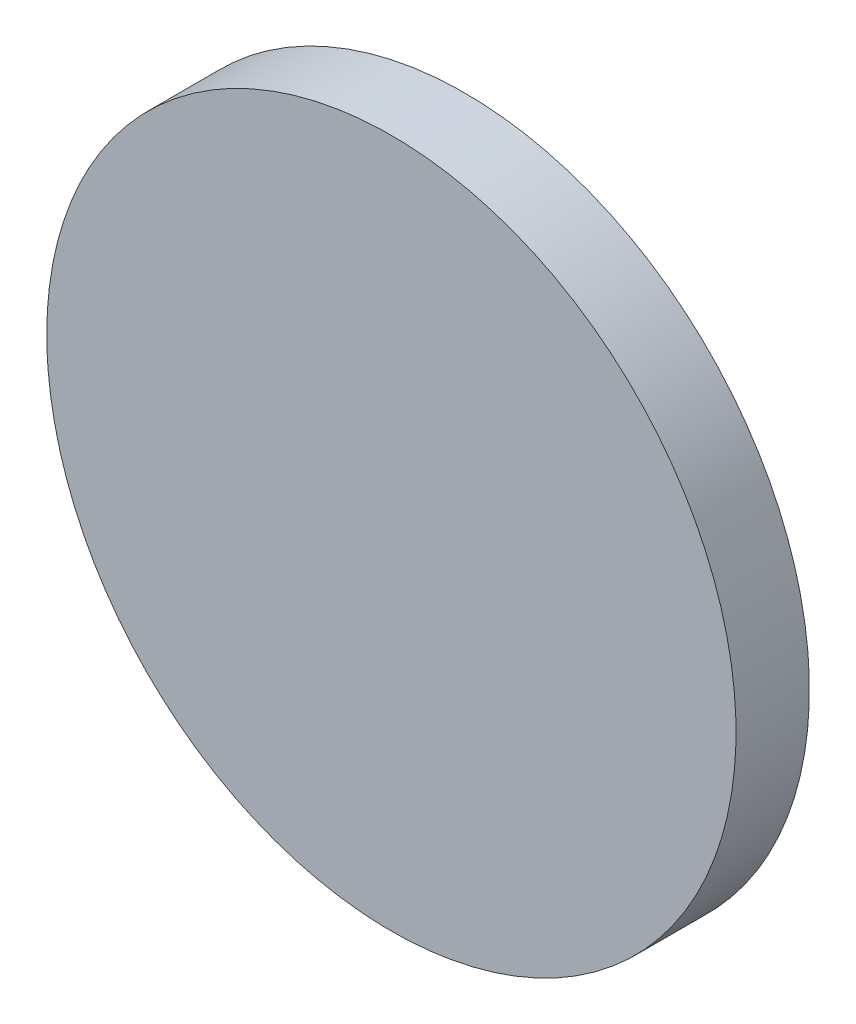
ISO-10303-21;
HEADER;
FILE_DESCRIPTION(('STEP AP214'),'2;1');
FILE_NAME('part.step','',(''),(''),'','','');
FILE_SCHEMA(('AUTOMOTIVE_DESIGN { 1 0 10303 214 1 1 1 1 }'));
ENDSEC;
DATA;
#1=APPLICATION_CONTEXT('core data for automotive mechanical design processes');
#2=APPLICATION_PROTOCOL_DEFINITION('international standard','automotive_design',2000,#1);
#3=PRODUCT_CONTEXT('',#1,'mechanical');
#4=PRODUCT('Part','Part','',(#3));
#5=PRODUCT_RELATED_PRODUCT_CATEGORY('part','',(#4));
#6=PRODUCT_DEFINITION_FORMATION('','',#4);
#7=PRODUCT_DEFINITION_CONTEXT('part definition',#1,'design');
#8=PRODUCT_DEFINITION('design','',#6,#7);
#9=PRODUCT_DEFINITION_SHAPE('','',#8);
#10=(LENGTH_UNIT() NAMED_UNIT(*) SI_UNIT(.MILLI.,.METRE.));
#11=(NAMED_UNIT(*) PLANE_ANGLE_UNIT() SI_UNIT($,.RADIAN.));
#12=(NAMED_UNIT(*) SI_UNIT($,.STERADIAN.) SOLID_ANGLE_UNIT());
#13=UNCERTAINTY_MEASURE_WITH_UNIT(LENGTH_MEASURE(1.E-05),#10,'distance_accuracy_value','');
#14=(GEOMETRIC_REPRESENTATION_CONTEXT(3) GLOBAL_UNCERTAINTY_ASSIGNED_CONTEXT((#13)) GLOBAL_UNIT_ASSIGNED_CONTEXT((#10,
#11,#12)) REPRESENTATION_CONTEXT('',''));
#15=CARTESIAN_POINT('',(0.,0.,0.));
#16=DIRECTION('',(0.,0.,1.));
#17=DIRECTION('',(1.,0.,0.));
#18=AXIS2_PLACEMENT_3D('',#15,#16,#17);
#19=CARTESIAN_POINT('',(-240.63228365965,-193.133656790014,-2576.69295055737));
#20=CARTESIAN_POINT('',(-240.632276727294,-194.816174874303,-2576.69295055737));
#21=CARTESIAN_POINT('',(-240.468140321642,-198.181301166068,-2576.69295055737));
#22=CARTESIAN_POINT('',(-239.724890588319,-203.179947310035,-2576.69295055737));
#23=CARTESIAN_POINT('',(-238.498671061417,-208.082666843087,-2576.69295055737));
#24=CARTESIAN_POINT('',(-236.794494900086,-212.84026258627,-2576.69295055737));
#25=CARTESIAN_POINT('',(-234.63535199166,-217.409599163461,-2576.69295055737));
#26=CARTESIAN_POINT('',(-232.035756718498,-221.743309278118,-2576.69295055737));
#27=CARTESIAN_POINT('',(-229.026667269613,-225.803613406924,-2576.69295055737));
#28=CARTESIAN_POINT('',(-225.63156373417,-229.54689629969,-2576.69295055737));
#29=CARTESIAN_POINT('',(-221.888168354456,-232.942140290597,-2576.69295055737));
#30=CARTESIAN_POINT('',(-217.828017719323,-235.951145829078,-2576.69295055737));
#31=CARTESIAN_POINT('',(-213.494168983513,-238.55085514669,-2576.69295055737));
#32=CARTESIAN_POINT('',(-208.925004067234,-240.709945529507,-2576.69295055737));
#33=CARTESIAN_POINT('',(-204.167253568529,-242.414204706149,-2576.69295055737));
#34=CARTESIAN_POINT('',(-199.264667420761,-243.640412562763,-2576.69295055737));
#35=CARTESIAN_POINT('',(-194.265851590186,-244.383737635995,-2576.69295055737));
#36=CARTESIAN_POINT('',(-189.218241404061,-244.629933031,-2576.69295055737));
#37=CARTESIAN_POINT('',(-184.170461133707,-244.383752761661,-2576.69295055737));
#38=CARTESIAN_POINT('',(-179.171808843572,-243.640479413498,-2576.69295055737));
#39=CARTESIAN_POINT('',(-174.269051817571,-242.414256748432,-2576.69295055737));
#40=CARTESIAN_POINT('',(-169.511452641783,-240.710076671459,-2576.69295055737));
#41=CARTESIAN_POINT('',(-164.942124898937,-238.550935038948,-2576.69295055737));
#42=CARTESIAN_POINT('',(-160.608410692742,-235.951338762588,-2576.69295055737));
#43=CARTESIAN_POINT('',(-156.548108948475,-232.942252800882,-2576.69295055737));
#44=CARTESIAN_POINT('',(-152.804821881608,-229.547141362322,-2576.69295055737));
#45=CARTESIAN_POINT('',(-149.409581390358,-225.803748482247,-2576.69295055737));
#46=CARTESIAN_POINT('',(-146.40057588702,-221.743597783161,-2576.69295055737));
#47=CARTESIAN_POINT('',(-143.800875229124,-217.409753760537,-2576.69295055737));
#48=CARTESIAN_POINT('',(-141.641781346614,-212.840590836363,-2576.69295055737));
#49=CARTESIAN_POINT('',(-139.937518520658,-208.082841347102,-2576.69295055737));
#50=CARTESIAN_POINT('',(-138.711313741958,-203.180249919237,-2576.69295055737));
#51=CARTESIAN_POINT('',(-137.967990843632,-198.181433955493,-2576.69295055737));
#52=CARTESIAN_POINT('',(-137.721793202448,-193.133828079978,-2576.69295055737));
#53=CARTESIAN_POINT('',(-137.967975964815,-188.0860522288,-2576.69295055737));
#54=CARTESIAN_POINT('',(-138.711244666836,-183.087407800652,-2576.69295055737));
#55=CARTESIAN_POINT('',(-139.937467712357,-178.184646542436,-2576.69295055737));
#56=CARTESIAN_POINT('',(-141.64164570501,-173.427051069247,-2576.69295055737));
#57=CARTESIAN_POINT('',(-143.800787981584,-168.857714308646,-2576.69295055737));
#58=CARTESIAN_POINT('',(-146.400386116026,-164.524001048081,-2576.69295055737));
#59=CARTESIAN_POINT('',(-149.40947394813,-160.463695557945,-2576.69295055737));
#60=CARTESIAN_POINT('',(-152.804585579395,-156.720408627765,-2576.69295055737));
#61=CARTESIAN_POINT('',(-156.54797832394,-153.325167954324,-2576.69295055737));
#62=CARTESIAN_POINT('',(-160.608132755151,-150.316160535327,-2576.69295055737));
#63=CARTESIAN_POINT('',(-164.941975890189,-147.716458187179,-2576.69295055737));
#64=CARTESIAN_POINT('',(-169.511143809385,-145.557364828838,-2576.69295055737));
#65=CARTESIAN_POINT('',(-174.268890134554,-143.853105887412,-2576.69295055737));
#66=CARTESIAN_POINT('',(-179.171480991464,-142.62689934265,-2576.69295055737));
#67=CARTESIAN_POINT('',(-184.170292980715,-141.883577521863,-2576.69295055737));
#68=CARTESIAN_POINT('',(-189.217902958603,-141.637380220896,-2576.69295055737));
#69=CARTESIAN_POINT('',(-194.26567907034,-141.883560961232,-2576.69295055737));
#70=CARTESIAN_POINT('',(-199.264331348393,-142.62683412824,-2576.69295055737));
#71=CARTESIAN_POINT('',(-204.167088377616,-143.853056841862,-2576.69295055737));
#72=CARTESIAN_POINT('',(-208.924687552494,-145.557236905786,-2576.69295055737));
#73=CARTESIAN_POINT('',(-213.49401529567,-147.716378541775,-2576.69295055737));
#74=CARTESIAN_POINT('',(-217.827729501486,-150.315974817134,-2576.69295055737));
#75=CARTESIAN_POINT('',(-221.888031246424,-153.325060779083,-2576.69295055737));
#76=CARTESIAN_POINT('',(-225.631318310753,-156.720172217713,-2576.69295055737));
#77=CARTESIAN_POINT('',(-229.026558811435,-160.463565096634,-2576.69295055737));
#78=CARTESIAN_POINT('',(-232.035564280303,-164.523715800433,-2576.69295055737));
#79=CARTESIAN_POINT('',(-234.635265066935,-168.857559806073,-2576.69295055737));
#80=CARTESIAN_POINT('',(-236.794358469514,-173.426722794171,-2576.69295055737));
#81=CARTESIAN_POINT('',(-238.498623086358,-178.18447204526,-2576.69295055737));
#82=CARTESIAN_POINT('',(-239.724831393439,-183.087105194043,-2576.69295055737));
#83=CARTESIAN_POINT('',(-240.468173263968,-188.085919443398,-2576.69295055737));
#84=CARTESIAN_POINT('',(-240.632290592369,-191.451050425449,-2576.69295055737));
#85=CARTESIAN_POINT('',(-240.63228365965,-193.133656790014,-2576.69295055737));
#86=B_SPLINE_CURVE_WITH_KNOTS('',3,(#19,#20,#21,#22,#23,#24,#25,#26,#27,#28,#29,#30,#31,#32,#33,
#34,#35,#36,#37,#38,#39,#40,#41,#42,#43,#44,#45,#46,#47,#48,#49,#50,#51,#52,#53,#54,#55,#56,#57,
#58,#59,#60,#61,#62,#63,#64,#65,#66,#67,#68,#69,#70,#71,#72,#73,#74,#75,#76,#77,#78,#79,#80,#81,
#82,#83,#84,#85),.UNSPECIFIED.,.T.,.F.,(4,1,1,1,1,1,1,1,1,1,1,1,1,1,1,1,1,1,1,1,1,1,1,1,1,1,1,1,
1,1,1,1,1,1,1,1,1,1,1,1,1,1,1,1,1,1,1,1,1,1,1,1,1,1,1,1,1,1,1,1,1,1,1,1,4),(0.,
0.0156245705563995,0.0312499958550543,0.0468741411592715,0.0624999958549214,0.0781241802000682,
0.0937499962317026,0.109374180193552,0.124999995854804,0.140624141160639,0.156249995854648,
0.17187418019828,0.187499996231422,0.203124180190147,0.218749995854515,0.234374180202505,
0.249999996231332,0.265624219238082,0.281249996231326,0.296874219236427,0.312499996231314,
0.328124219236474,0.343749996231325,0.35937421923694,0.374999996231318,0.390624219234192,
0.406249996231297,0.421874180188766,0.437499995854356,0.453124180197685,0.468749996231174,
0.484374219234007,0.499999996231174,0.515624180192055,0.531249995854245,0.546874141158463,
0.562499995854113,0.578124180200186,0.593749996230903,0.609374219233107,0.624999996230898,
0.64062421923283,0.656249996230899,0.671874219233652,0.687499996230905,0.703124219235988,
0.71874999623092,0.73437421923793,0.749999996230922,0.765624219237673,0.781249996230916,
0.796874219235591,0.812499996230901,0.828124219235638,0.843749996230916,0.859374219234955,
0.874999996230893,0.890624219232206,0.906249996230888,0.921874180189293,0.937499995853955,
0.953124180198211,0.968749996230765,0.984374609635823,1.),.UNSPECIFIED.);
#87=DIRECTION('',(0.,0.,-1.));
#88=VECTOR('',#87,1.);
#89=SURFACE_OF_LINEAR_EXTRUSION('',#86,#88);
#90=CARTESIAN_POINT('',(-240.63228365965,-193.133656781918,-2576.69295055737));
#91=CARTESIAN_POINT('',(-240.632284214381,-192.305332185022,-2576.69295055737));
#92=CARTESIAN_POINT('',(-240.612400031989,-191.476989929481,-2576.69295055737));
#93=CARTESIAN_POINT('',(-240.532662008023,-189.822252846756,-2576.69295055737));
#94=CARTESIAN_POINT('',(-240.472809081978,-188.995857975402,-2576.69295055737));
#95=CARTESIAN_POINT('',(-240.312933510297,-187.346961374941,-2576.69295055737));
#96=CARTESIAN_POINT('',(-240.212910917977,-186.524459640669,-2576.69295055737));
#97=CARTESIAN_POINT('',(-239.973247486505,-184.885236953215,-2576.69295055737));
#98=CARTESIAN_POINT('',(-239.833605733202,-184.068516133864,-2576.69295055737));
#99=CARTESIAN_POINT('',(-239.515285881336,-182.442716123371,-2576.69295055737));
#100=CARTESIAN_POINT('',(-239.336607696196,-181.633636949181,-2576.69295055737));
#101=CARTESIAN_POINT('',(-238.94042890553,-180.025052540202,-2576.69295055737));
#102=CARTESIAN_POINT('',(-238.722929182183,-179.225547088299,-2576.69295055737));
#103=CARTESIAN_POINT('',(-238.249262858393,-177.638075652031,-2576.69295055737));
#104=CARTESIAN_POINT('',(-237.993096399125,-176.850109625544,-2576.69295055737));
#105=CARTESIAN_POINT('',(-237.442968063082,-175.287470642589,-2576.69295055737));
#106=CARTESIAN_POINT('',(-237.149005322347,-174.512797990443,-2576.69295055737));
#107=CARTESIAN_POINT('',(-236.524233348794,-172.97845368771,-2576.69295055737));
#108=CARTESIAN_POINT('',(-236.193423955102,-172.218782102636,-2576.69295055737));
#109=CARTESIAN_POINT('',(-235.495566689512,-170.716283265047,-2576.69295055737));
#110=CARTESIAN_POINT('',(-235.128519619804,-169.973455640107,-2576.69295055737));
#111=CARTESIAN_POINT('',(-234.358704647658,-168.506550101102,-2576.69295055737));
#112=CARTESIAN_POINT('',(-233.955936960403,-167.782472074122,-2576.69295055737));
#113=CARTESIAN_POINT('',(-233.115840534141,-166.354636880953,-2576.69295055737));
#114=CARTESIAN_POINT('',(-232.67851101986,-165.650880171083,-2576.69295055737));
#115=CARTESIAN_POINT('',(-231.770569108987,-164.26517004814,-2576.69295055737));
#116=CARTESIAN_POINT('',(-231.299956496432,-163.583216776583,-2576.69295055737));
#117=CARTESIAN_POINT('',(-230.326422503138,-162.242789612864,-2576.69295055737));
#118=CARTESIAN_POINT('',(-229.823501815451,-161.584315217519,-2576.69295055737));
#119=CARTESIAN_POINT('',(-228.786216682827,-160.292623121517,-2576.69295055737));
#120=CARTESIAN_POINT('',(-228.251852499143,-159.659405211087,-2576.69295055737));
#121=CARTESIAN_POINT('',(-227.153089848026,-158.419570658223,-2576.69295055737));
#122=CARTESIAN_POINT('',(-226.588690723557,-157.812954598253,-2576.69295055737));
#123=CARTESIAN_POINT('',(-225.431413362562,-156.627518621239,-2576.69295055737));
#124=CARTESIAN_POINT('',(-224.838534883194,-156.048698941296,-2576.69295055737));
#125=CARTESIAN_POINT('',(-223.625596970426,-154.920292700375,-2576.69295055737));
#126=CARTESIAN_POINT('',(-223.00553809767,-154.370705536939,-2576.69295055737));
#127=CARTESIAN_POINT('',(-221.73942488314,-153.302347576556,-2576.69295055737));
#128=CARTESIAN_POINT('',(-221.093370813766,-152.783576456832,-2576.69295055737));
#129=CARTESIAN_POINT('',(-219.776881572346,-151.777932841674,-2576.69295055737));
#130=CARTESIAN_POINT('',(-219.106445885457,-151.291061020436,-2576.69295055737));
#131=CARTESIAN_POINT('',(-217.742960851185,-150.350074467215,-2576.69295055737));
#132=CARTESIAN_POINT('',(-217.049911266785,-149.895960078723,-2576.69295055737));
#133=CARTESIAN_POINT('',(-215.642764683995,-149.021624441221,-2576.69295055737));
#134=CARTESIAN_POINT('',(-214.928668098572,-148.601402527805,-2576.69295055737));
#135=CARTESIAN_POINT('',(-213.480893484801,-147.796180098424,-2576.69295055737));
#136=CARTESIAN_POINT('',(-212.747215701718,-147.411179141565,-2576.69295055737));
#137=CARTESIAN_POINT('',(-211.262049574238,-146.67719087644,-2576.69295055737));
#138=CARTESIAN_POINT('',(-210.51056087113,-146.328204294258,-2576.69295055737));
#139=CARTESIAN_POINT('',(-208.991679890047,-145.66673246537,-2576.69295055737));
#140=CARTESIAN_POINT('',(-208.224287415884,-145.354247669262,-2576.69295055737));
#141=CARTESIAN_POINT('',(-206.675365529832,-144.766565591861,-2576.69295055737));
#142=CARTESIAN_POINT('',(-205.893836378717,-144.491367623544,-2576.69295055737));
#143=CARTESIAN_POINT('',(-204.318335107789,-143.979279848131,-2576.69295055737));
#144=CARTESIAN_POINT('',(-203.524363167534,-143.742389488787,-2576.69295055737));
#145=CARTESIAN_POINT('',(-201.925852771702,-143.307399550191,-2576.69295055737));
#146=CARTESIAN_POINT('',(-201.121314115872,-143.109300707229,-2576.69295055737));
#147=CARTESIAN_POINT('',(-199.503639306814,-142.751992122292,-2576.69295055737));
#148=CARTESIAN_POINT('',(-198.690503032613,-142.59278292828,-2576.69295055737));
#149=CARTESIAN_POINT('',(-197.057523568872,-142.313656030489,-2576.69295055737));
#150=CARTESIAN_POINT('',(-196.237680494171,-142.193737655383,-2576.69295055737));
#151=CARTESIAN_POINT('',(-194.593146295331,-141.993863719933,-2576.69295055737));
#152=CARTESIAN_POINT('',(-193.76845524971,-141.913907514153,-2576.69295055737));
#153=CARTESIAN_POINT('',(-192.116154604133,-141.794119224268,-2576.69295055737));
#154=CARTESIAN_POINT('',(-191.288544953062,-141.754287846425,-2576.69295055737));
#155=CARTESIAN_POINT('',(-189.632359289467,-141.714455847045,-2576.69295055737));
#156=CARTESIAN_POINT('',(-188.803783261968,-141.7144558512,-2576.69295055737));
#157=CARTESIAN_POINT('',(-187.147597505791,-141.754287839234,-2576.69295055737));
#158=CARTESIAN_POINT('',(-186.319987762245,-141.794119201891,-2576.69295055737));
#159=CARTESIAN_POINT('',(-184.667687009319,-141.91390737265,-2576.69295055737));
#160=CARTESIAN_POINT('',(-183.842995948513,-141.993863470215,-2576.69295055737));
#161=CARTESIAN_POINT('',(-182.198461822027,-142.193737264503,-2576.69295055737));
#162=CARTESIAN_POINT('',(-181.378618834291,-142.313655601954,-2576.69295055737));
#163=CARTESIAN_POINT('',(-179.745639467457,-142.592782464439,-2576.69295055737));
#164=CARTESIAN_POINT('',(-178.932503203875,-142.751991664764,-2576.69295055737));
#165=CARTESIAN_POINT('',(-177.314828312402,-143.109300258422,-2576.69295055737));
#166=CARTESIAN_POINT('',(-176.510289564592,-143.307399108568,-2576.69295055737));
#167=CARTESIAN_POINT('',(-174.911779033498,-143.742388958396,-2576.69295055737));
#168=CARTESIAN_POINT('',(-174.117807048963,-143.979279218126,-2576.69295055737));
#169=CARTESIAN_POINT('',(-172.542305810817,-144.491366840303,-2576.69295055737));
#170=CARTESIAN_POINT('',(-171.760776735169,-144.766564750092,-2576.69295055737));
#171=CARTESIAN_POINT('',(-170.211854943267,-145.35424676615,-2576.69295055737));
#172=CARTESIAN_POINT('',(-169.444462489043,-145.666731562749,-2576.69295055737));
#173=CARTESIAN_POINT('',(-167.925581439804,-146.328203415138,-2576.69295055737));
#174=CARTESIAN_POINT('',(-167.174092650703,-146.677190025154,-2576.69295055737));
#175=CARTESIAN_POINT('',(-165.688926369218,-147.411178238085,-2576.69295055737));
#176=CARTESIAN_POINT('',(-164.955248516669,-147.79617911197,-2576.69295055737));
#177=CARTESIAN_POINT('',(-163.507473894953,-148.601401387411,-2576.69295055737));
#178=CARTESIAN_POINT('',(-162.793377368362,-149.02162322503,-2576.69295055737));
#179=CARTESIAN_POINT('',(-161.386230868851,-149.895958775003,-2576.69295055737));
#180=CARTESIAN_POINT('',(-160.693181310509,-150.350073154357,-2576.69295055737));
#181=CARTESIAN_POINT('',(-159.32969622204,-151.291059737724,-2576.69295055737));
#182=CARTESIAN_POINT('',(-158.659260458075,-151.777931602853,-2576.69295055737));
#183=CARTESIAN_POINT('',(-157.342771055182,-152.78357520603,-2576.69295055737));
#184=CARTESIAN_POINT('',(-156.696716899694,-153.302346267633,-2576.69295055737));
#185=CARTESIAN_POINT('',(-155.430603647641,-154.370704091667,-2576.69295055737));
#186=CARTESIAN_POINT('',(-154.810544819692,-154.920291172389,-2576.69295055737));
#187=CARTESIAN_POINT('',(-153.597606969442,-156.048697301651,-2576.69295055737));
#188=CARTESIAN_POINT('',(-153.004728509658,-156.62751695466,-2576.69295055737));
#189=CARTESIAN_POINT('',(-151.847451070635,-157.812952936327,-2576.69295055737));
#190=CARTESIAN_POINT('',(-151.283051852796,-158.419569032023,-2576.69295055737));
#191=CARTESIAN_POINT('',(-150.184289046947,-159.659403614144,-2576.69295055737));
#192=CARTESIAN_POINT('',(-149.649924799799,-160.29262151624,-2576.69295055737));
#193=CARTESIAN_POINT('',(-148.61263974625,-161.584313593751,-2576.69295055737));
#194=CARTESIAN_POINT('',(-148.10971919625,-162.242787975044,-2576.69295055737));
#195=CARTESIAN_POINT('',(-147.136185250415,-163.583215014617,-2576.69295055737));
#196=CARTESIAN_POINT('',(-146.665572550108,-164.265168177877,-2576.69295055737));
#197=CARTESIAN_POINT('',(-145.757629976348,-165.650877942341,-2576.69295055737));
#198=CARTESIAN_POINT('',(-145.320299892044,-166.354634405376,-2576.69295055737));
#199=CARTESIAN_POINT('',(-144.48020248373,-167.782469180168,-2576.69295055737));
#200=CARTESIAN_POINT('',(-144.077434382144,-168.506547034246,-2576.69295055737));
#201=CARTESIAN_POINT('',(-143.307619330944,-169.973452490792,-2576.69295055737));
#202=CARTESIAN_POINT('',(-142.940572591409,-170.716280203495,-2576.69295055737));
#203=CARTESIAN_POINT('',(-142.242716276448,-172.218779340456,-2576.69295055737));
#204=CARTESIAN_POINT('',(-141.911907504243,-172.978451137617,-2576.69295055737));
#205=CARTESIAN_POINT('',(-141.287136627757,-174.512795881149,-2576.69295055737));
#206=CARTESIAN_POINT('',(-140.99317436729,-175.287468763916,-2576.69295055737));
#207=CARTESIAN_POINT('',(-140.443046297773,-176.850107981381,-2576.69295055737));
#208=CARTESIAN_POINT('',(-140.18687962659,-177.638074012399,-2576.69295055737));
#209=CARTESIAN_POINT('',(-139.713211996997,-179.225545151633,-2576.69295055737));
#210=CARTESIAN_POINT('',(-139.495711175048,-180.025050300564,-2576.69295055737));
#211=CARTESIAN_POINT('',(-139.099531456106,-181.633634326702,-2576.69295055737));
#212=CARTESIAN_POINT('',(-138.920853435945,-182.442713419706,-2576.69295055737));
#213=CARTESIAN_POINT('',(-138.602536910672,-184.068514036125,-2576.69295055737));
#214=CARTESIAN_POINT('',(-138.462898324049,-184.885235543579,-2576.69295055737));
#215=CARTESIAN_POINT('',(-138.223240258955,-186.524458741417,-2576.69295055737));
#216=CARTESIAN_POINT('',(-138.123219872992,-187.346960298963,-2576.69295055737));
#217=CARTESIAN_POINT('',(-137.963345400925,-188.995858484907,-2576.69295055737));
#218=CARTESIAN_POINT('',(-137.903491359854,-189.822255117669,-2576.69295055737));
#219=CARTESIAN_POINT('',(-137.8237465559,-191.476986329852,-2576.69295055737));
#220=CARTESIAN_POINT('',(-137.803856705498,-192.305320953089,-2576.69295055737));
#221=CARTESIAN_POINT('',(-137.80385636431,-193.961990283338,-2576.69295055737));
#222=CARTESIAN_POINT('',(-137.82374587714,-194.79032499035,-2576.69295055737));
#223=CARTESIAN_POINT('',(-137.903490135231,-196.445056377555,-2576.69295055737));
#224=CARTESIAN_POINT('',(-137.963343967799,-197.271453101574,-2576.69295055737));
#225=CARTESIAN_POINT('',(-138.123218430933,-198.920351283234,-2576.69295055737));
#226=CARTESIAN_POINT('',(-138.223239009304,-199.742852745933,-2576.69295055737));
#227=CARTESIAN_POINT('',(-138.46289753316,-201.382075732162,-2576.69295055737));
#228=CARTESIAN_POINT('',(-138.602536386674,-202.198797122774,-2576.69295055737));
#229=CARTESIAN_POINT('',(-138.920852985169,-203.824597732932,-2576.69295055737));
#230=CARTESIAN_POINT('',(-139.099530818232,-204.63367693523,-2576.69295055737));
#231=CARTESIAN_POINT('',(-139.495709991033,-206.242261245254,-2576.69295055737));
#232=CARTESIAN_POINT('',(-139.71321045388,-207.041766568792,-2576.69295055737));
#233=CARTESIAN_POINT('',(-140.186877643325,-208.629237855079,-2576.69295055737));
#234=CARTESIAN_POINT('',(-140.443044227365,-209.417203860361,-2576.69295055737));
#235=CARTESIAN_POINT('',(-140.993172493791,-210.979842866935,-2576.69295055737));
#236=CARTESIAN_POINT('',(-141.287135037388,-211.754515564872,-2576.69295055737));
#237=CARTESIAN_POINT('',(-141.911906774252,-213.288859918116,-2576.69295055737));
#238=CARTESIAN_POINT('',(-142.242716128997,-214.048531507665,-2576.69295055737));
#239=CARTESIAN_POINT('',(-142.94057340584,-215.551030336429,-2576.69295055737));
#240=CARTESIAN_POINT('',(-143.307620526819,-216.293857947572,-2576.69295055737));
#241=CARTESIAN_POINT('',(-144.077435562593,-217.760763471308,-2576.69295055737));
#242=CARTESIAN_POINT('',(-144.480203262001,-218.484841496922,-2576.69295055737));
#243=CARTESIAN_POINT('',(-145.320299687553,-219.912676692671,-2576.69295055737));
#244=CARTESIAN_POINT('',(-145.757629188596,-220.616433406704,-2576.69295055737));
#245=CARTESIAN_POINT('',(-146.665571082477,-222.002143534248,-2576.69295055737));
#246=CARTESIAN_POINT('',(-147.136183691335,-222.684096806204,-2576.69295055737));
#247=CARTESIAN_POINT('',(-148.1097176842,-224.02452396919,-2576.69295055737));
#248=CARTESIAN_POINT('',(-148.612638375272,-224.682998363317,-2576.69295055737));
#249=CARTESIAN_POINT('',(-149.649923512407,-225.974690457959,-2576.69295055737));
#250=CARTESIAN_POINT('',(-150.184287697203,-226.60790836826,-2576.69295055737));
#251=CARTESIAN_POINT('',(-151.28305034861,-227.847742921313,-2576.69295055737));
#252=CARTESIAN_POINT('',(-151.847449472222,-228.454358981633,-2576.69295055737));
#253=CARTESIAN_POINT('',(-153.00472683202,-229.639794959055,-2576.69295055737));
#254=CARTESIAN_POINT('',(-153.597605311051,-230.218614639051,-2576.69295055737));
#255=CARTESIAN_POINT('',(-154.810543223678,-231.347020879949,-2576.69295055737));
#256=CARTESIAN_POINT('',(-155.430602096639,-231.896608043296,-2576.69295055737));
#257=CARTESIAN_POINT('',(-156.696715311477,-232.964966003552,-2576.69295055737));
#258=CARTESIAN_POINT('',(-157.342769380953,-233.483737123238,-2576.69295055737));
#259=CARTESIAN_POINT('',(-158.659258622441,-234.48938073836,-2576.69295055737));
#260=CARTESIAN_POINT('',(-159.329694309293,-234.976252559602,-2576.69295055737));
#261=CARTESIAN_POINT('',(-160.693179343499,-235.9172391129,-2576.69295055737));
#262=CARTESIAN_POINT('',(-161.386228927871,-236.371353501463,-2576.69295055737));
#263=CARTESIAN_POINT('',(-162.793375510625,-237.245689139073,-2576.69295055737));
#264=CARTESIAN_POINT('',(-163.50747209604,-237.665911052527,-2576.69295055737));
#265=CARTESIAN_POINT('',(-164.955246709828,-238.471133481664,-2576.69295055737));
#266=CARTESIAN_POINT('',(-165.688924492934,-238.856134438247,-2576.69295055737));
#267=CARTESIAN_POINT('',(-167.174090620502,-239.590122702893,-2576.69295055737));
#268=CARTESIAN_POINT('',(-167.925579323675,-239.939109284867,-2576.69295055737));
#269=CARTESIAN_POINT('',(-169.444460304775,-240.600581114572,-2576.69295055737));
#270=CARTESIAN_POINT('',(-170.211852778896,-240.913065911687,-2576.69295055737));
#271=CARTESIAN_POINT('',(-171.760774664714,-241.500747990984,-2576.69295055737));
#272=CARTESIAN_POINT('',(-172.542303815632,-241.775945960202,-2576.69295055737));
#273=CARTESIAN_POINT('',(-174.117805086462,-242.288033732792,-2576.69295055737));
#274=CARTESIAN_POINT('',(-174.911777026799,-242.524924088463,-2576.69295055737));
#275=CARTESIAN_POINT('',(-176.510287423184,-242.959914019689,-2576.69295055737));
#276=CARTESIAN_POINT('',(-177.314826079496,-243.158012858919,-2576.69295055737));
#277=CARTESIAN_POINT('',(-178.932500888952,-243.515321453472,-2576.69295055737));
#278=CARTESIAN_POINT('',(-179.7456371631,-243.674530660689,-2576.69295055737));
#279=CARTESIAN_POINT('',(-181.378616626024,-243.953657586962,-2576.69295055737));
#280=CARTESIAN_POINT('',(-182.198459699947,-244.073575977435,-2576.69295055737));
#281=CARTESIAN_POINT('',(-183.84299389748,-244.273449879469,-2576.69295055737));
#282=CARTESIAN_POINT('',(-184.66768494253,-244.35340603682,-2576.69295055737));
#283=CARTESIAN_POINT('',(-186.319985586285,-244.473194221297,-2576.69295055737));
#284=CARTESIAN_POINT('',(-187.147595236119,-244.513025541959,-2576.69295055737));
#285=CARTESIAN_POINT('',(-188.803780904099,-244.552857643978,-2576.69295055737));
#286=CARTESIAN_POINT('',(-189.632356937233,-244.552857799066,-2576.69295055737));
#287=CARTESIAN_POINT('',(-191.288542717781,-244.513026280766,-2576.69295055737));
#288=CARTESIAN_POINT('',(-192.116152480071,-244.473195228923,-2576.69295055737));
#289=CARTESIAN_POINT('',(-193.768453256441,-244.353407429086,-2576.69295055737));
#290=CARTESIAN_POINT('',(-194.593144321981,-244.273451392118,-2576.69295055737));
#291=CARTESIAN_POINT('',(-196.237678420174,-244.073577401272,-2576.69295055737));
#292=CARTESIAN_POINT('',(-197.057521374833,-243.953658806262,-2576.69295055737));
#293=CARTESIAN_POINT('',(-198.690500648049,-243.674531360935,-2576.69295055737));
#294=CARTESIAN_POINT('',(-199.503636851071,-243.515321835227,-2576.69295055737));
#295=CARTESIAN_POINT('',(-201.121311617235,-243.158012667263,-2576.69295055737));
#296=CARTESIAN_POINT('',(-201.925850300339,-242.959913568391,-2576.69295055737));
#297=CARTESIAN_POINT('',(-203.524360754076,-242.524923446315,-2576.69295055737));
#298=CARTESIAN_POINT('',(-204.318332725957,-242.288033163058,-2576.69295055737));
#299=CARTESIAN_POINT('',(-205.893834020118,-241.775945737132,-2576.69295055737));
#300=CARTESIAN_POINT('',(-206.675363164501,-241.500748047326,-2576.69295055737));
#301=CARTESIAN_POINT('',(-208.224285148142,-240.913066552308,-2576.69295055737));
#302=CARTESIAN_POINT('',(-208.991677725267,-240.60058205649,-2576.69295055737));
#303=CARTESIAN_POINT('',(-210.510559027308,-239.939110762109,-2576.69295055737));
#304=CARTESIAN_POINT('',(-211.262047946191,-239.590124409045,-2576.69295055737));
#305=CARTESIAN_POINT('',(-212.747214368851,-238.856136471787,-2576.69295055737));
#306=CARTESIAN_POINT('',(-213.480892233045,-238.471135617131,-2576.69295055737));
#307=CARTESIAN_POINT('',(-214.928666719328,-237.665913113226,-2576.69295055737));
#308=CARTESIAN_POINT('',(-215.642763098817,-237.245691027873,-2576.69295055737));
#309=CARTESIAN_POINT('',(-217.049909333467,-236.371355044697,-2576.69295055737));
#310=CARTESIAN_POINT('',(-217.74295877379,-235.917240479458,-2576.69295055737));
#311=CARTESIAN_POINT('',(-219.106443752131,-234.976253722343,-2576.69295055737));
#312=CARTESIAN_POINT('',(-219.776879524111,-234.489381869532,-2576.69295055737));
#313=CARTESIAN_POINT('',(-221.09336899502,-233.483738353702,-2576.69295055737));
#314=CARTESIAN_POINT('',(-221.739423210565,-232.964967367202,-2576.69295055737));
#315=CARTESIAN_POINT('',(-223.005536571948,-231.896609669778,-2576.69295055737));
#316=CARTESIAN_POINT('',(-223.625595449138,-231.347022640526,-2576.69295055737));
#317=CARTESIAN_POINT('',(-224.838533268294,-230.218616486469,-2576.69295055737));
#318=CARTESIAN_POINT('',(-225.431411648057,-229.639796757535,-2576.69295055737));
#319=CARTESIAN_POINT('',(-226.588688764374,-228.454360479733,-2576.69295055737));
#320=CARTESIAN_POINT('',(-227.153087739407,-227.847744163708,-2576.69295055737));
#321=CARTESIAN_POINT('',(-228.251850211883,-226.607909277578,-2576.69295055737));
#322=CARTESIAN_POINT('',(-228.786214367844,-225.974691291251,-2576.69295055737));
#323=CARTESIAN_POINT('',(-229.823499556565,-224.682999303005,-2576.69295055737));
#324=CARTESIAN_POINT('',(-230.32642033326,-224.024525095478,-2576.69295055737));
#325=CARTESIAN_POINT('',(-231.299954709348,-222.684098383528,-2576.69295055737));
#326=CARTESIAN_POINT('',(-231.770567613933,-222.002145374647,-2576.69295055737));
#327=CARTESIAN_POINT('',(-232.678510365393,-220.616435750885,-2576.69295055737));
#328=CARTESIAN_POINT('',(-233.115840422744,-219.912679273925,-2576.69295055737));
#329=CARTESIAN_POINT('',(-233.955937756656,-218.484844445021,-2576.69295055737));
#330=CARTESIAN_POINT('',(-234.358705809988,-217.760766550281,-2576.69295055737));
#331=CARTESIAN_POINT('',(-235.128520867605,-216.293861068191,-2576.69295055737));
#332=CARTESIAN_POINT('',(-235.4955676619,-215.551033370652,-2576.69295055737));
#333=CARTESIAN_POINT('',(-236.193424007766,-214.048534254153,-2576.69295055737));
#334=CARTESIAN_POINT('',(-236.524232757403,-213.288862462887,-2576.69295055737));
#335=CARTESIAN_POINT('',(-237.149003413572,-211.75451768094,-2576.69295055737));
#336=CARTESIAN_POINT('',(-237.442965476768,-210.979844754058,-2576.69295055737));
#337=CARTESIAN_POINT('',(-237.993093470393,-209.417205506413,-2576.69295055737));
#338=CARTESIAN_POINT('',(-238.249260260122,-208.629239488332,-2576.69295055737));
#339=CARTESIAN_POINT('',(-238.722928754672,-207.041768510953,-2576.69295055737));
#340=CARTESIAN_POINT('',(-238.940430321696,-206.242263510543,-2576.69295055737));
#341=CARTESIAN_POINT('',(-239.336610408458,-204.6336795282,-2576.69295055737));
#342=CARTESIAN_POINT('',(-239.515288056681,-203.824600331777,-2576.69295055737));
#343=CARTESIAN_POINT('',(-239.833601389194,-202.198799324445,-2576.69295055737));
#344=CARTESIAN_POINT('',(-239.973237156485,-201.382077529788,-2576.69295055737));
#345=CARTESIAN_POINT('',(-240.212890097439,-199.74285325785,-2576.69295055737));
#346=CARTESIAN_POINT('',(-240.312908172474,-198.92035091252,-2576.69295055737));
#347=CARTESIAN_POINT('',(-240.472782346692,-197.271454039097,-2576.69295055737));
#348=CARTESIAN_POINT('',(-240.53263840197,-196.44505950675,-2576.69295055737));
#349=CARTESIAN_POINT('',(-240.612386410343,-194.790323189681,-2576.69295055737));
#350=CARTESIAN_POINT('',(-240.632277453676,-193.961981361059,-2576.69295055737));
#351=CARTESIAN_POINT('',(-240.63228365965,-193.133656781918,-2576.69295055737));
#352=B_SPLINE_CURVE_WITH_KNOTS('',3,(#90,#91,#92,#93,#94,#95,#96,#97,#98,#99,#100,#101,#102,
#103,#104,#105,#106,#107,#108,#109,#110,#111,#112,#113,#114,#115,#116,#117,#118,#119,#120,#121,
#122,#123,#124,#125,#126,#127,#128,#129,#130,#131,#132,#133,#134,#135,#136,#137,#138,#139,#140,
#141,#142,#143,#144,#145,#146,#147,#148,#149,#150,#151,#152,#153,#154,#155,#156,#157,#158,#159,
#160,#161,#162,#163,#164,#165,#166,#167,#168,#169,#170,#171,#172,#173,#174,#175,#176,#177,#178,
#179,#180,#181,#182,#183,#184,#185,#186,#187,#188,#189,#190,#191,#192,#193,#194,#195,#196,#197,
#198,#199,#200,#201,#202,#203,#204,#205,#206,#207,#208,#209,#210,#211,#212,#213,#214,#215,#216,
#217,#218,#219,#220,#221,#222,#223,#224,#225,#226,#227,#228,#229,#230,#231,#232,#233,#234,#235,
#236,#237,#238,#239,#240,#241,#242,#243,#244,#245,#246,#247,#248,#249,#250,#251,#252,#253,#254,
#255,#256,#257,#258,#259,#260,#261,#262,#263,#264,#265,#266,#267,#268,#269,#270,#271,#272,#273,
#274,#275,#276,#277,#278,#279,#280,#281,#282,#283,#284,#285,#286,#287,#288,#289,#290,#291,#292,
#293,#294,#295,#296,#297,#298,#299,#300,#301,#302,#303,#304,#305,#306,#307,#308,#309,#310,#311,
#312,#313,#314,#315,#316,#317,#318,#319,#320,#321,#322,#323,#324,#325,#326,#327,#328,#329,#330,
#331,#332,#333,#334,#335,#336,#337,#338,#339,#340,#341,#342,#343,#344,#345,#346,#347,#348,#349,
#350,#351),.UNSPECIFIED.,.F.,.F.,(4,2,2,2,2,2,2,2,2,2,2,2,2,2,2,2,2,2,2,2,2,2,2,2,2,2,2,2,2,2,2,
2,2,2,2,2,2,2,2,2,2,2,2,2,2,2,2,2,2,2,2,2,2,2,2,2,2,2,2,2,2,2,2,2,2,2,2,2,2,2,2,2,2,2,2,2,2,2,2,
2,2,2,2,2,2,2,2,2,2,2,2,2,2,2,2,2,2,2,2,2,2,2,2,2,2,2,2,2,2,2,2,2,2,2,2,2,2,2,2,2,2,2,2,2,2,2,2,
2,2,2,4),(0.,2.48476343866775,4.96946996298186,7.45417318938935,9.93893375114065,
12.4236998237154,14.9084094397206,17.393109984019,19.8778673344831,22.3626355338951,
24.8473487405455,27.3320469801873,29.8168009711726,32.3015710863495,34.7862879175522,
37.270984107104,39.7557346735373,42.2405064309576,44.7252269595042,47.2099214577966,
49.6946684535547,52.1794415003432,54.6641658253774,57.1488590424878,59.6336023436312,
62.118376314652,64.6031044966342,67.087796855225,69.5725363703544,72.057310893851,
74.5420429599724,77.026734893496,79.5114705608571,81.9962452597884,84.4809812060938,
86.965673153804,89.4504049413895,91.9351794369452,94.4199192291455,96.9046116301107,
99.3893395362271,101.874113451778,104.35885702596,106.843550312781,109.328274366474,
111.813047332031,114.29779459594,116.782489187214,119.267209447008,121.751981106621,
124.236731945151,126.721428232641,129.206144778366,131.690914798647,134.17566907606,
136.66036743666,139.145080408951,141.629848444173,144.114605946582,146.599306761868,
149.084016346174,151.568782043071,154.053542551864,156.538246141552,159.022952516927,
161.507715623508,163.99247895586,166.477185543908,168.961888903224,171.446649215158,
173.931415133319,176.416124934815,178.900825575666,181.385582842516,183.870350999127,
186.355064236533,188.839762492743,191.324516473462,193.80928658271,196.294003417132,
198.778699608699,201.263450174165,203.748221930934,206.232942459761,208.717636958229,
211.202383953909,213.687157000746,216.171881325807,218.65657454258,221.141317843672,
223.626091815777,226.110819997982,228.595512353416,231.080251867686,233.565026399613,
236.049758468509,238.53445038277,241.019186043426,243.503960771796,245.988696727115,
248.473388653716,250.958120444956,253.442894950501,255.927634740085,258.412327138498,
260.897055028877,263.381828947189,265.866572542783,268.35126581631,270.83598985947,
273.320762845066,275.805510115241,278.290204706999,280.774924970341,283.259696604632,
285.744447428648,288.229143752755,290.713860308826,293.19863028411,295.683384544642,
298.168082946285,300.652795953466,303.137563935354,305.622321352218,308.107022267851,
310.591732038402,313.076497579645,315.561257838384,318.045961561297,320.530668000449,
323.015431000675),.UNSPECIFIED.);
#353=CARTESIAN_POINT('',(-240.63228365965,-193.133656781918,-2576.69295055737));
#354=VERTEX_POINT('',#353);
#355=EDGE_CURVE('E10',#354,#354,#352,.F.);
#356=ORIENTED_EDGE('',*,*,#355,.F.);
#357=EDGE_LOOP('',(#356));
#358=FACE_BOUND('',#357,.T.);
#359=CARTESIAN_POINT('',(-240.63228365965,-193.133656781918,-2587.63929697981));
#360=CARTESIAN_POINT('',(-240.632271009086,-193.806675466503,-2587.63929697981));
#361=CARTESIAN_POINT('',(-240.619143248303,-194.479701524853,-2587.63929697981));
#362=CARTESIAN_POINT('',(-240.566527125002,-195.824709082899,-2587.63929697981));
#363=CARTESIAN_POINT('',(-240.527039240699,-196.496690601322,-2587.63929697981));
#364=CARTESIAN_POINT('',(-240.421573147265,-197.83856600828,-2587.63929697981));
#365=CARTESIAN_POINT('',(-240.35559526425,-198.508459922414,-2587.63929697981));
#366=CARTESIAN_POINT('',(-240.197247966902,-199.845127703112,-2587.63929697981));
#367=CARTESIAN_POINT('',(-240.104878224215,-200.511901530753,-2587.63929697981));
#368=CARTESIAN_POINT('',(-239.894090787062,-201.841328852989,-2587.63929697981));
#369=CARTESIAN_POINT('',(-239.775672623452,-202.503982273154,-2587.63929697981));
#370=CARTESIAN_POINT('',(-239.51307478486,-203.824164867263,-2587.63929697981));
#371=CARTESIAN_POINT('',(-239.368895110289,-204.481694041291,-2587.63929697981));
#372=CARTESIAN_POINT('',(-239.054891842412,-205.790590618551,-2587.63929697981));
#373=CARTESIAN_POINT('',(-238.885068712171,-206.441958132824,-2587.63929697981));
#374=CARTESIAN_POINT('',(-238.519844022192,-207.737475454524,-2587.63929697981));
#375=CARTESIAN_POINT('',(-238.324442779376,-208.381625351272,-2587.63929697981));
#376=CARTESIAN_POINT('',(-237.908363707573,-209.661716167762,-2587.63929697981));
#377=CARTESIAN_POINT('',(-237.687685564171,-210.297656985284,-2587.63929697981));
#378=CARTESIAN_POINT('',(-237.221585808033,-211.560415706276,-2587.63929697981));
#379=CARTESIAN_POINT('',(-236.97616374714,-212.187233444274,-2587.63929697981));
#380=CARTESIAN_POINT('',(-236.461054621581,-213.430818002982,-2587.63929697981));
#381=CARTESIAN_POINT('',(-236.191367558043,-214.047584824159,-2587.63929697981));
#382=CARTESIAN_POINT('',(-235.628045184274,-215.270072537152,-2587.63929697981));
#383=CARTESIAN_POINT('',(-235.33441030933,-215.875793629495,-2587.63929697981));
#384=CARTESIAN_POINT('',(-234.723461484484,-217.075166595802,-2587.63929697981));
#385=CARTESIAN_POINT('',(-234.406147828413,-217.668818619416,-2587.63929697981));
#386=CARTESIAN_POINT('',(-233.748330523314,-218.843139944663,-2587.63929697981));
#387=CARTESIAN_POINT('',(-233.40782658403,-219.423809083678,-2587.63929697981));
#388=CARTESIAN_POINT('',(-232.704330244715,-220.571372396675,-2587.63929697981));
#389=CARTESIAN_POINT('',(-232.341337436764,-221.138266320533,-2587.63929697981));
#390=CARTESIAN_POINT('',(-231.593513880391,-222.257462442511,-2587.63929697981));
#391=CARTESIAN_POINT('',(-231.208683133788,-222.809764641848,-2587.63929697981));
#392=CARTESIAN_POINT('',(-230.417688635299,-223.898863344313,-2587.63929697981));
#393=CARTESIAN_POINT('',(-230.011525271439,-224.435660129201,-2587.63929697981));
#394=CARTESIAN_POINT('',(-229.178329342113,-225.492797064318,-2587.63929697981));
#395=CARTESIAN_POINT('',(-228.751297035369,-226.013137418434,-2587.63929697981));
#396=CARTESIAN_POINT('',(-227.877021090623,-227.036560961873,-2587.63929697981));
#397=CARTESIAN_POINT('',(-227.42977719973,-227.539643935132,-2587.63929697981));
#398=CARTESIAN_POINT('',(-226.515920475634,-228.527912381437,-2587.63929697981));
#399=CARTESIAN_POINT('',(-226.049307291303,-229.01309752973,-2587.63929697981));
#400=CARTESIAN_POINT('',(-225.097509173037,-229.964896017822,-2587.63929697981));
#401=CARTESIAN_POINT('',(-224.612324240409,-230.431509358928,-2587.63929697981));
#402=CARTESIAN_POINT('',(-223.624056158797,-231.345366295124,-2587.63929697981));
#403=CARTESIAN_POINT('',(-223.120973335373,-231.792610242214,-2587.63929697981));
#404=CARTESIAN_POINT('',(-222.097549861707,-232.666886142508,-2587.63929697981));
#405=CARTESIAN_POINT('',(-221.577209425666,-233.093918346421,-2587.63929697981));
#406=CARTESIAN_POINT('',(-220.520072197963,-233.927114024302,-2587.63929697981));
#407=CARTESIAN_POINT('',(-219.983275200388,-234.333277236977,-2587.63929697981));
#408=CARTESIAN_POINT('',(-218.894176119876,-235.124271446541,-2587.63929697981));
#409=CARTESIAN_POINT('',(-218.341873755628,-235.509102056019,-2587.63929697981));
#410=CARTESIAN_POINT('',(-217.22267748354,-236.256925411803,-2587.63929697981));
#411=CARTESIAN_POINT('',(-216.655783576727,-236.619918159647,-2587.63929697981));
#412=CARTESIAN_POINT('',(-215.508220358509,-237.323414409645,-2587.63929697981));
#413=CARTESIAN_POINT('',(-214.927551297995,-237.663918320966,-2587.63929697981));
#414=CARTESIAN_POINT('',(-213.753230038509,-238.321735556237,-2587.63929697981));
#415=CARTESIAN_POINT('',(-213.159578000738,-238.639049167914,-2587.63929697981));
#416=CARTESIAN_POINT('',(-211.960204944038,-239.249997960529,-2587.63929697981));
#417=CARTESIAN_POINT('',(-211.354483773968,-239.543632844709,-2587.63929697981));
#418=CARTESIAN_POINT('',(-210.131995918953,-240.10695523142,-2587.63929697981));
#419=CARTESIAN_POINT('',(-209.515229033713,-240.376642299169,-2587.63929697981));
#420=CARTESIAN_POINT('',(-208.271644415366,-240.891751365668,-2587.63929697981));
#421=CARTESIAN_POINT('',(-207.644826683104,-241.13717336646,-2587.63929697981));
#422=CARTESIAN_POINT('',(-206.382067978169,-241.60327286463,-2587.63929697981));
#423=CARTESIAN_POINT('',(-205.746127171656,-241.823950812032,-2587.63929697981));
#424=CARTESIAN_POINT('',(-204.466036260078,-242.24002916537,-2587.63929697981));
#425=CARTESIAN_POINT('',(-203.821886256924,-242.435429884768,-2587.63929697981));
#426=CARTESIAN_POINT('',(-202.526368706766,-242.800653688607,-2587.63929697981));
#427=CARTESIAN_POINT('',(-201.875001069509,-242.97047645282,-2587.63929697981));
#428=CARTESIAN_POINT('',(-200.56610443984,-243.284480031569,-2587.63929697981));
#429=CARTESIAN_POINT('',(-199.908575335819,-243.428660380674,-2587.63929697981));
#430=CARTESIAN_POINT('',(-198.588393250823,-243.691261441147,-2587.63929697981));
#431=CARTESIAN_POINT('',(-197.92574027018,-243.809682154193,-2587.63929697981));
#432=CARTESIAN_POINT('',(-196.596313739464,-244.020474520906,-2587.63929697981));
#433=CARTESIAN_POINT('',(-195.929540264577,-244.112846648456,-2587.63929697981));
#434=CARTESIAN_POINT('',(-194.592873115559,-244.271197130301,-2587.63929697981));
#435=CARTESIAN_POINT('',(-193.922979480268,-244.337175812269,-2587.63929697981));
#436=CARTESIAN_POINT('',(-192.581103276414,-244.442638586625,-2587.63929697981));
#437=CARTESIAN_POINT('',(-191.909120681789,-244.482122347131,-2587.63929697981));
#438=CARTESIAN_POINT('',(-190.56411503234,-244.534738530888,-2587.63929697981));
#439=CARTESIAN_POINT('',(-189.891091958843,-244.547870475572,-2587.63929697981));
#440=CARTESIAN_POINT('',(-188.545045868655,-244.547870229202,-2587.63929697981));
#441=CARTESIAN_POINT('',(-187.872022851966,-244.534738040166,-2587.63929697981));
#442=CARTESIAN_POINT('',(-186.527017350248,-244.482121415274,-2587.63929697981));
#443=CARTESIAN_POINT('',(-185.855034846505,-244.44263745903,-2587.63929697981));
#444=CARTESIAN_POINT('',(-184.513158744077,-244.337174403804,-2587.63929697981));
#445=CARTESIAN_POINT('',(-183.843265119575,-244.271195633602,-2587.63929697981));
#446=CARTESIAN_POINT('',(-182.506597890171,-244.112845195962,-2587.63929697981));
#447=CARTESIAN_POINT('',(-181.839824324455,-244.020473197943,-2587.63929697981));
#448=CARTESIAN_POINT('',(-180.510397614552,-243.809681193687,-2587.63929697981));
#449=CARTESIAN_POINT('',(-179.847744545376,-243.691260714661,-2587.63929697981));
#450=CARTESIAN_POINT('',(-178.527562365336,-243.42866013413,-2587.63929697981));
#451=CARTESIAN_POINT('',(-177.870033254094,-243.284480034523,-2587.63929697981));
#452=CARTESIAN_POINT('',(-176.561136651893,-242.970476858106,-2587.63929697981));
#453=CARTESIAN_POINT('',(-175.909769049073,-242.800654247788,-2587.63929697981));
#454=CARTESIAN_POINT('',(-174.614251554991,-242.435430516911,-2587.63929697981));
#455=CARTESIAN_POINT('',(-173.970101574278,-242.240029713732,-2587.63929697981));
#456=CARTESIAN_POINT('',(-172.690010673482,-241.823951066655,-2587.63929697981));
#457=CARTESIAN_POINT('',(-172.054069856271,-241.603272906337,-2587.63929697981));
#458=CARTESIAN_POINT('',(-170.791311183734,-241.137172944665,-2587.63929697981));
#459=CARTESIAN_POINT('',(-170.164493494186,-240.891750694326,-2587.63929697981));
#460=CARTESIAN_POINT('',(-168.920909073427,-240.376641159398,-2587.63929697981));
#461=CARTESIAN_POINT('',(-168.304142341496,-240.106953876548,-2587.63929697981));
#462=CARTESIAN_POINT('',(-167.081654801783,-239.54363112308,-2587.63929697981));
#463=CARTESIAN_POINT('',(-166.475933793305,-239.249996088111,-2587.63929697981));
#464=CARTESIAN_POINT('',(-165.276560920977,-238.639047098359,-2587.63929697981));
#465=CARTESIAN_POINT('',(-164.682908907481,-238.321733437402,-2587.63929697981));
#466=CARTESIAN_POINT('',(-163.508587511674,-237.663916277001,-2587.63929697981));
#467=CARTESIAN_POINT('',(-162.927918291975,-237.323412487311,-2587.63929697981));
#468=CARTESIAN_POINT('',(-161.780354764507,-236.619916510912,-2587.63929697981));
#469=CARTESIAN_POINT('',(-161.213460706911,-236.256923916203,-2587.63929697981));
#470=CARTESIAN_POINT('',(-160.094264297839,-235.509100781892,-2587.63929697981));
#471=CARTESIAN_POINT('',(-159.541961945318,-235.124270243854,-2587.63929697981));
#472=CARTESIAN_POINT('',(-158.452862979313,-234.333276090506,-2587.63929697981));
#473=CARTESIAN_POINT('',(-157.916066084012,-233.927112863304,-2587.63929697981));
#474=CARTESIAN_POINT('',(-156.858929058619,-233.093917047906,-2587.63929697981));
#475=CARTESIAN_POINT('',(-156.33858872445,-232.666884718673,-2587.63929697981));
#476=CARTESIAN_POINT('',(-155.315165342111,-231.792608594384,-2587.63929697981));
#477=CARTESIAN_POINT('',(-154.812082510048,-231.34536454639,-2587.63929697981));
#478=CARTESIAN_POINT('',(-153.823814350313,-230.431507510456,-2587.63929697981));
#479=CARTESIAN_POINT('',(-153.338629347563,-229.964894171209,-2587.63929697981));
#480=CARTESIAN_POINT('',(-152.386831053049,-229.013095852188,-2587.63929697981));
#481=CARTESIAN_POINT('',(-151.920217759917,-228.527910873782,-2587.63929697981));
#482=CARTESIAN_POINT('',(-151.006360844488,-227.539642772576,-2587.63929697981));
#483=CARTESIAN_POINT('',(-150.559116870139,-227.036559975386,-2587.63929697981));
#484=CARTESIAN_POINT('',(-149.684840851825,-226.013136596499,-2587.63929697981));
#485=CARTESIAN_POINT('',(-149.257808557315,-225.492796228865,-2587.63929697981));
#486=CARTESIAN_POINT('',(-148.424612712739,-224.435659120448,-2587.63929697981));
#487=CARTESIAN_POINT('',(-148.018449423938,-223.898862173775,-2587.63929697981));
#488=CARTESIAN_POINT('',(-147.227455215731,-222.809763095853,-2587.63929697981));
#489=CARTESIAN_POINT('',(-146.842624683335,-222.257460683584,-2587.63929697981));
#490=CARTESIAN_POINT('',(-146.09480176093,-221.13826414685,-2587.63929697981));
#491=CARTESIAN_POINT('',(-145.731809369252,-220.571370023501,-2587.63929697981));
#492=CARTESIAN_POINT('',(-145.028313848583,-219.42380636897,-2587.63929697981));
#493=CARTESIAN_POINT('',(-144.687810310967,-218.843137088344,-2587.63929697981));
#494=CARTESIAN_POINT('',(-144.029993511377,-217.668815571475,-2587.63929697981));
#495=CARTESIAN_POINT('',(-143.712679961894,-217.075163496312,-2587.63929697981));
#496=CARTESIAN_POINT('',(-143.101730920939,-215.875790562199,-2587.63929697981));
#497=CARTESIAN_POINT('',(-142.808095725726,-215.270069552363,-2587.63929697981));
#498=CARTESIAN_POINT('',(-142.24477255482,-214.04758207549,-2587.63929697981));
#499=CARTESIAN_POINT('',(-141.975085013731,-213.43081540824,-2587.63929697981));
#500=CARTESIAN_POINT('',(-141.459974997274,-212.187231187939,-2587.63929697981));
#501=CARTESIAN_POINT('',(-141.214552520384,-211.56041363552,-2587.63929697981));
#502=CARTESIAN_POINT('',(-140.748452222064,-210.297655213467,-2587.63929697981));
#503=CARTESIAN_POINT('',(-140.527773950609,-209.661714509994,-2587.63929697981));
#504=CARTESIAN_POINT('',(-140.11169530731,-208.381623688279,-2587.63929697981));
#505=CARTESIAN_POINT('',(-139.916294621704,-207.737473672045,-2587.63929697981));
#506=CARTESIAN_POINT('',(-139.551071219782,-206.441956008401,-2587.63929697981));
#507=CARTESIAN_POINT('',(-139.381248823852,-205.790588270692,-2587.63929697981));
#508=CARTESIAN_POINT('',(-139.067246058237,-204.481691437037,-2587.63929697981));
#509=CARTESIAN_POINT('',(-138.923066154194,-203.824162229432,-2587.63929697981));
#510=CARTESIAN_POINT('',(-138.660465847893,-202.503979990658,-2587.63929697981));
#511=CARTESIAN_POINT('',(-138.542045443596,-201.841326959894,-2587.63929697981));
#512=CARTESIAN_POINT('',(-138.33125351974,-200.511900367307,-2587.63929697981));
#513=CARTESIAN_POINT('',(-138.238881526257,-199.845126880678,-2587.63929697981));
#514=CARTESIAN_POINT('',(-138.080531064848,-198.508459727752,-2587.63929697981));
#515=CARTESIAN_POINT('',(-138.014552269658,-197.838566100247,-2587.63929697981));
#516=CARTESIAN_POINT('',(-137.909089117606,-196.49668991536,-2587.63929697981));
#517=CARTESIAN_POINT('',(-137.869605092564,-195.824707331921,-2587.63929697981));
#518=CARTESIAN_POINT('',(-137.816988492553,-194.479701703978,-2587.63929697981));
#519=CARTESIAN_POINT('',(-137.80385639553,-193.806678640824,-2587.63929697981));
#520=CARTESIAN_POINT('',(-137.803856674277,-192.460632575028,-2587.63929697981));
#521=CARTESIAN_POINT('',(-137.816989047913,-191.787609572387,-2587.63929697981));
#522=CARTESIAN_POINT('',(-137.869606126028,-190.442604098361,-2587.63929697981));
#523=CARTESIAN_POINT('',(-137.909090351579,-189.770621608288,-2587.63929697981));
#524=CARTESIAN_POINT('',(-138.014553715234,-188.428745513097,-2587.63929697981));
#525=CARTESIAN_POINT('',(-138.080532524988,-187.758851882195,-2587.63929697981));
#526=CARTESIAN_POINT('',(-138.238882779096,-186.422184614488,-2587.63929697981));
#527=CARTESIAN_POINT('',(-138.33125455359,-185.755411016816,-2587.63929697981));
#528=CARTESIAN_POINT('',(-138.542046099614,-184.425984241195,-2587.63929697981));
#529=CARTESIAN_POINT('',(-138.660466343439,-183.763331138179,-2587.63929697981));
#530=CARTESIAN_POINT('',(-138.923066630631,-182.443148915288,-2587.63929697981));
#531=CARTESIAN_POINT('',(-139.067246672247,-181.785619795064,-2587.63929697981));
#532=CARTESIAN_POINT('',(-139.381249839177,-180.476723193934,-2587.63929697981));
#533=CARTESIAN_POINT('',(-139.551072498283,-179.825355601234,-2587.63929697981));
#534=CARTESIAN_POINT('',(-139.916296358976,-178.529838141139,-2587.63929697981));
#535=CARTESIAN_POINT('',(-140.111697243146,-177.885688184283,-2587.63929697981));
#536=CARTESIAN_POINT('',(-140.527776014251,-176.605597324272,-2587.63929697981));
#537=CARTESIAN_POINT('',(-140.748454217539,-175.969656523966,-2587.63929697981));
#538=CARTESIAN_POINT('',(-141.2145541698,-174.706897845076,-2587.63929697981));
#539=CARTESIAN_POINT('',(-141.459976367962,-174.080080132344,-2587.63929697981));
#540=CARTESIAN_POINT('',(-141.975085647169,-172.836495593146,-2587.63929697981));
#541=CARTESIAN_POINT('',(-142.244772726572,-172.219728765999,-2587.63929697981));
#542=CARTESIAN_POINT('',(-142.808095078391,-170.997241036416,-2587.63929697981));
#543=CARTESIAN_POINT('',(-143.101729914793,-170.391519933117,-2587.63929697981));
#544=CARTESIAN_POINT('',(-143.712678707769,-169.192146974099,-2587.63929697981));
#545=CARTESIAN_POINT('',(-144.029992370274,-168.598494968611,-2587.63929697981));
#546=CARTESIAN_POINT('',(-144.687809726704,-167.424173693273,-2587.63929697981));
#547=CARTESIAN_POINT('',(-145.028313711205,-166.843504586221,-2587.63929697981));
#548=CARTESIAN_POINT('',(-145.731810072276,-165.695941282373,-2587.63929697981));
#549=CARTESIAN_POINT('',(-146.094802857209,-165.129047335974,-2587.63929697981));
#550=CARTESIAN_POINT('',(-146.842626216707,-164.009851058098,-2587.63929697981));
#551=CARTESIAN_POINT('',(-147.227456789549,-163.457548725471,-2587.63929697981));
#552=CARTESIAN_POINT('',(-148.018450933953,-162.368449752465,-2587.63929697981));
#553=CARTESIAN_POINT('',(-148.424614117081,-161.831652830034,-2587.63929697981));
#554=CARTESIAN_POINT('',(-149.257809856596,-160.77451575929,-2587.63929697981));
#555=CARTESIAN_POINT('',(-149.684842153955,-160.25417540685,-2587.63929697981));
#556=CARTESIAN_POINT('',(-150.559118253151,-159.230752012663,-2587.63929697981));
#557=CARTESIAN_POINT('',(-151.006362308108,-158.727669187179,-2587.63929697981));
#558=CARTESIAN_POINT('',(-151.920219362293,-157.739401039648,-2587.63929697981));
#559=CARTESIAN_POINT('',(-152.386832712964,-157.254216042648,-2587.63929697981));
#560=CARTESIAN_POINT('',(-153.338631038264,-156.302417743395,-2587.63929697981));
#561=CARTESIAN_POINT('',(-153.82381601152,-155.835804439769,-2587.63929697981));
#562=CARTESIAN_POINT('',(-154.812084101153,-154.92194750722,-2587.63929697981));
#563=CARTESIAN_POINT('',(-155.315166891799,-154.474703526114,-2587.63929697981));
#564=CARTESIAN_POINT('',(-156.338590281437,-153.600427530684,-2587.63929697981));
#565=CARTESIAN_POINT('',(-156.858930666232,-153.173395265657,-2587.63929697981));
#566=CARTESIAN_POINT('',(-157.916067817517,-152.340199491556,-2587.63929697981));
#567=CARTESIAN_POINT('',(-158.452864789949,-151.934036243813,-2587.63929697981));
#568=CARTESIAN_POINT('',(-159.541963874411,-151.143042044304,-2587.63929697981));
#569=CARTESIAN_POINT('',(-160.09426626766,-150.75821147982,-2587.63929697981));
#570=CARTESIAN_POINT('',(-161.213462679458,-150.010388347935,-2587.63929697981));
#571=CARTESIAN_POINT('',(-161.780356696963,-149.647395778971,-2587.63929697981));
#572=CARTESIAN_POINT('',(-162.927920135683,-148.943899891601,-2587.63929697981));
#573=CARTESIAN_POINT('',(-163.508589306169,-148.60339616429,-2587.63929697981));
#574=CARTESIAN_POINT('',(-164.682910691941,-147.94557913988,-2587.63929697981));
#575=CARTESIAN_POINT('',(-165.276562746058,-147.628265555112,-2587.63929697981));
#576=CARTESIAN_POINT('',(-166.475935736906,-147.017316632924,-2587.63929697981));
#577=CARTESIAN_POINT('',(-167.081656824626,-146.723681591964,-2587.63929697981));
#578=CARTESIAN_POINT('',(-168.304144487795,-146.160358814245,-2587.63929697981));
#579=CARTESIAN_POINT('',(-168.920911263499,-145.890671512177,-2587.63929697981));
#580=CARTESIAN_POINT('',(-170.164495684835,-145.375561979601,-2587.63929697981));
#581=CARTESIAN_POINT('',(-170.79131332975,-145.130139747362,-2587.63929697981));
#582=CARTESIAN_POINT('',(-172.054071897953,-144.664039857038,-2587.63929697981));
#583=CARTESIAN_POINT('',(-172.690012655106,-144.443361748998,-2587.63929697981));
#584=CARTESIAN_POINT('',(-173.970103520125,-144.027283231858,-2587.63929697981));
#585=CARTESIAN_POINT('',(-174.61425352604,-143.831882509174,-2587.63929697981));
#586=CARTESIAN_POINT('',(-175.90977112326,-143.466658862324,-2587.63929697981));
#587=CARTESIAN_POINT('',(-176.561138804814,-143.296836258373,-2587.63929697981));
#588=CARTESIAN_POINT('',(-177.870035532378,-142.982833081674,-2587.63929697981));
#589=CARTESIAN_POINT('',(-178.527564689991,-142.838652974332,-2587.63929697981));
#590=CARTESIAN_POINT('',(-179.847746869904,-142.576052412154,-2587.63929697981));
#591=CARTESIAN_POINT('',(-180.51039989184,-142.457631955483,-2587.63929697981));
#592=CARTESIAN_POINT('',(-181.83982648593,-142.246840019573,-2587.63929697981));
#593=CARTESIAN_POINT('',(-182.506599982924,-142.154468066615,-2587.63929697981));
#594=CARTESIAN_POINT('',(-183.843267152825,-141.996117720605,-2587.63929697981));
#595=CARTESIAN_POINT('',(-184.513160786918,-141.930139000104,-2587.63929697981));
#596=CARTESIAN_POINT('',(-185.855036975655,-141.824675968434,-2587.63929697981));
#597=CARTESIAN_POINT('',(-186.527019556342,-141.785191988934,-2587.63929697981));
#598=CARTESIAN_POINT('',(-187.872025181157,-141.732575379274,-2587.63929697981));
#599=CARTESIAN_POINT('',(-188.545048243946,-141.71944322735,-2587.63929697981));
#600=CARTESIAN_POINT('',(-189.891094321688,-141.719443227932,-2587.63929697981));
#601=CARTESIAN_POINT('',(-190.564117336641,-141.732575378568,-2587.63929697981));
#602=CARTESIAN_POINT('',(-191.909122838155,-141.785192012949,-2587.63929697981));
#603=CARTESIAN_POINT('',(-192.581105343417,-141.824676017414,-2587.63929697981));
#604=CARTESIAN_POINT('',(-193.922981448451,-141.930139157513,-2587.63929697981));
#605=CARTESIAN_POINT('',(-194.592875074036,-141.996117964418,-2587.63929697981));
#606=CARTESIAN_POINT('',(-195.929542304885,-142.15446843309,-2587.63929697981));
#607=CARTESIAN_POINT('',(-196.596315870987,-142.246840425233,-2587.63929697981));
#608=CARTESIAN_POINT('',(-197.925742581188,-142.457632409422,-2587.63929697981));
#609=CARTESIAN_POINT('',(-198.58839565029,-142.576052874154,-2587.63929697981));
#610=CARTESIAN_POINT('',(-199.908577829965,-142.838653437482,-2587.63929697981));
#611=CARTESIAN_POINT('',(-200.566106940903,-142.982833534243,-2587.63929697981));
#612=CARTESIAN_POINT('',(-201.875003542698,-143.296836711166,-2587.63929697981));
#613=CARTESIAN_POINT('',(-202.526371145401,-143.466659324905,-2587.63929697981));
#614=CARTESIAN_POINT('',(-203.821888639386,-143.831883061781,-2587.63929697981));
#615=CARTESIAN_POINT('',(-204.466038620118,-144.027283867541,-2587.63929697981));
#616=CARTESIAN_POINT('',(-205.746129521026,-144.44336251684,-2587.63929697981));
#617=CARTESIAN_POINT('',(-206.382070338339,-144.664040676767,-2587.63929697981));
#618=CARTESIAN_POINT('',(-207.644829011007,-145.130140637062,-2587.63929697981));
#619=CARTESIAN_POINT('',(-208.271646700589,-145.375562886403,-2587.63929697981));
#620=CARTESIAN_POINT('',(-209.515231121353,-145.890672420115,-2587.63929697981));
#621=CARTESIAN_POINT('',(-210.131997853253,-146.160359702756,-2587.63929697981));
#622=CARTESIAN_POINT('',(-211.354485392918,-146.72368245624,-2587.63929697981));
#623=CARTESIAN_POINT('',(-211.960206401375,-147.017317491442,-2587.63929697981));
#624=CARTESIAN_POINT('',(-213.159579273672,-147.628266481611,-2587.63929697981));
#625=CARTESIAN_POINT('',(-213.753231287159,-147.94558014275,-2587.63929697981));
#626=CARTESIAN_POINT('',(-214.927552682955,-148.603397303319,-2587.63929697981));
#627=CARTESIAN_POINT('',(-215.508221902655,-148.94390109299,-2587.63929697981));
#628=CARTESIAN_POINT('',(-216.655785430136,-149.647397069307,-2587.63929697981));
#629=CARTESIAN_POINT('',(-217.222679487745,-150.010389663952,-2587.63929697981));
#630=CARTESIAN_POINT('',(-218.341875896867,-150.758212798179,-2587.63929697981));
#631=CARTESIAN_POINT('',(-218.894178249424,-151.143043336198,-2587.63929697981));
#632=CARTESIAN_POINT('',(-219.983277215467,-151.934037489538,-2587.63929697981));
#633=CARTESIAN_POINT('',(-220.52007411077,-152.340200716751,-2587.63929697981));
#634=CARTESIAN_POINT('',(-221.57721113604,-153.173396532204,-2587.63929697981));
#635=CARTESIAN_POINT('',(-222.097551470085,-153.600428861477,-2587.63929697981));
#636=CARTESIAN_POINT('',(-223.120974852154,-154.474704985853,-2587.63929697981));
#637=CARTESIAN_POINT('',(-223.624057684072,-154.921949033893,-2587.63929697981));
#638=CARTESIAN_POINT('',(-224.612325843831,-155.835806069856,-2587.63929697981));
#639=CARTESIAN_POINT('',(-225.097510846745,-156.302419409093,-2587.63929697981));
#640=CARTESIAN_POINT('',(-226.049309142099,-157.254217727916,-2587.63929697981));
#641=CARTESIAN_POINT('',(-226.515922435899,-157.739402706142,-2587.63929697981));
#642=CARTESIAN_POINT('',(-227.429779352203,-158.727670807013,-2587.63929697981));
#643=CARTESIAN_POINT('',(-227.877023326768,-159.230753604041,-2587.63929697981));
#644=CARTESIAN_POINT('',(-228.751299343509,-160.254176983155,-2587.63929697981));
#645=CARTESIAN_POINT('',(-229.178331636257,-160.774517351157,-2587.63929697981));
#646=CARTESIAN_POINT('',(-230.011527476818,-161.831654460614,-2587.63929697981));
#647=CARTESIAN_POINT('',(-230.417690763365,-162.36845140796,-2587.63929697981));
#648=CARTESIAN_POINT('',(-231.208684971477,-163.457550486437,-2587.63929697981));
#649=CARTESIAN_POINT('',(-231.593515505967,-164.009852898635,-2587.63929697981));
#650=CARTESIAN_POINT('',(-232.341338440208,-165.129049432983,-2587.63929697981));
#651=CARTESIAN_POINT('',(-232.70433084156,-165.695943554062,-2587.63929697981));
#652=CARTESIAN_POINT('',(-233.407826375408,-166.843507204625,-2587.63929697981));
#653=CARTESIAN_POINT('',(-233.748329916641,-167.424176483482,-2587.63929697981));
#654=CARTESIAN_POINT('',(-234.406146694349,-168.598498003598,-2587.63929697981));
#655=CARTESIAN_POINT('',(-234.723460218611,-169.192150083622,-2587.63929697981));
#656=CARTESIAN_POINT('',(-235.334409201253,-170.391523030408,-2587.63929697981));
#657=CARTESIAN_POINT('',(-235.628044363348,-170.997244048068,-2587.63929697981));
#658=CARTESIAN_POINT('',(-236.191367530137,-172.219731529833,-2587.63929697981));
#659=CARTESIAN_POINT('',(-236.461055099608,-172.836498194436,-2587.63929697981));
#660=CARTESIAN_POINT('',(-236.976165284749,-174.08008238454,-2587.63929697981));
#661=CARTESIAN_POINT('',(-237.221587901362,-174.70689990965,-2587.63929697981));
#662=CARTESIAN_POINT('',(-237.687688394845,-175.969658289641,-2587.63929697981));
#663=CARTESIAN_POINT('',(-237.9083667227,-176.605598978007,-2587.63929697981));
#664=CARTESIAN_POINT('',(-238.324445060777,-177.885689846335,-2587.63929697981));
#665=CARTESIAN_POINT('',(-238.519845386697,-178.529839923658,-2587.63929697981));
#666=CARTESIAN_POINT('',(-238.885067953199,-179.825357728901,-2587.63929697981));
#667=CARTESIAN_POINT('',(-239.054889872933,-180.476725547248,-2587.63929697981));
#668=CARTESIAN_POINT('',(-239.368892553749,-181.785622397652,-2587.63929697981));
#669=CARTESIAN_POINT('',(-239.513072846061,-182.443151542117,-2587.63929697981));
#670=CARTESIAN_POINT('',(-239.775675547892,-183.763333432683,-2587.63929697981));
#671=CARTESIAN_POINT('',(-239.894097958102,-184.425986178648,-2587.63929697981));
#672=CARTESIAN_POINT('',(-240.104894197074,-185.755412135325,-2587.63929697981));
#673=CARTESIAN_POINT('',(-240.197268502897,-186.422185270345,-2587.63929697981));
#674=CARTESIAN_POINT('',(-240.355621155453,-187.758852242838,-2587.63929697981));
#675=CARTESIAN_POINT('',(-240.421599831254,-188.428746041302,-2587.63929697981));
#676=CARTESIAN_POINT('',(-240.527063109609,-189.770621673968,-2587.63929697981));
#677=CARTESIAN_POINT('',(-240.566547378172,-190.442603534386,-2587.63929697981));
#678=CARTESIAN_POINT('',(-240.619154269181,-191.787611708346,-2587.63929697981));
#679=CARTESIAN_POINT('',(-240.63227641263,-192.460638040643,-2587.63929697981));
#680=CARTESIAN_POINT('',(-240.63228365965,-193.133656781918,-2587.63929697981));
#681=B_SPLINE_CURVE_WITH_KNOTS('',3,(#359,#360,#361,#362,#363,#364,#365,#366,#367,#368,#369,
#370,#371,#372,#373,#374,#375,#376,#377,#378,#379,#380,#381,#382,#383,#384,#385,#386,#387,#388,
#389,#390,#391,#392,#393,#394,#395,#396,#397,#398,#399,#400,#401,#402,#403,#404,#405,#406,#407,
#408,#409,#410,#411,#412,#413,#414,#415,#416,#417,#418,#419,#420,#421,#422,#423,#424,#425,#426,
#427,#428,#429,#430,#431,#432,#433,#434,#435,#436,#437,#438,#439,#440,#441,#442,#443,#444,#445,
#446,#447,#448,#449,#450,#451,#452,#453,#454,#455,#456,#457,#458,#459,#460,#461,#462,#463,#464,
#465,#466,#467,#468,#469,#470,#471,#472,#473,#474,#475,#476,#477,#478,#479,#480,#481,#482,#483,
#484,#485,#486,#487,#488,#489,#490,#491,#492,#493,#494,#495,#496,#497,#498,#499,#500,#501,#502,
#503,#504,#505,#506,#507,#508,#509,#510,#511,#512,#513,#514,#515,#516,#517,#518,#519,#520,#521,
#522,#523,#524,#525,#526,#527,#528,#529,#530,#531,#532,#533,#534,#535,#536,#537,#538,#539,#540,
#541,#542,#543,#544,#545,#546,#547,#548,#549,#550,#551,#552,#553,#554,#555,#556,#557,#558,#559,
#560,#561,#562,#563,#564,#565,#566,#567,#568,#569,#570,#571,#572,#573,#574,#575,#576,#577,#578,
#579,#580,#581,#582,#583,#584,#585,#586,#587,#588,#589,#590,#591,#592,#593,#594,#595,#596,#597,
#598,#599,#600,#601,#602,#603,#604,#605,#606,#607,#608,#609,#610,#611,#612,#613,#614,#615,#616,
#617,#618,#619,#620,#621,#622,#623,#624,#625,#626,#627,#628,#629,#630,#631,#632,#633,#634,#635,
#636,#637,#638,#639,#640,#641,#642,#643,#644,#645,#646,#647,#648,#649,#650,#651,#652,#653,#654,
#655,#656,#657,#658,#659,#660,#661,#662,#663,#664,#665,#666,#667,#668,#669,#670,#671,#672,#673,
#674,#675,#676,#677,#678,#679,#680),.UNSPECIFIED.,.F.,.F.,(4,2,2,2,2,2,2,2,2,2,2,2,2,2,2,2,2,2,
2,2,2,2,2,2,2,2,2,2,2,2,2,2,2,2,2,2,2,2,2,2,2,2,2,2,2,2,2,2,2,2,2,2,2,2,2,2,2,2,2,2,2,2,2,2,2,2,
2,2,2,2,2,2,2,2,2,2,2,2,2,2,2,2,2,2,2,2,2,2,2,2,2,2,2,2,2,2,2,2,2,2,2,2,2,2,2,2,2,2,2,2,2,2,2,2,
2,2,2,2,2,2,2,2,2,2,2,2,2,2,2,2,2,2,2,2,2,2,2,2,2,2,2,2,2,2,2,2,2,2,2,2,2,2,2,2,2,2,2,2,2,2,4),
(0.,2.01894005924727,4.03784349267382,6.05672207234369,8.07562577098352,10.0945658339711,
12.1135058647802,14.1324094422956,16.1512880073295,18.1701916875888,20.1891319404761,
22.2080720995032,24.2269755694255,26.2458539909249,28.2647576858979,30.2836980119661,
32.3026381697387,34.3215416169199,36.3404200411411,38.3593237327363,40.3782640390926,
42.3972042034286,44.4161076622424,46.4349860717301,48.4538897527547,50.4728300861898,
52.4917702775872,54.510673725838,56.5295521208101,58.5484558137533,60.5673961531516,
62.5863363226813,64.6052397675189,66.6241181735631,68.6430218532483,70.6619621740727,
72.6809023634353,74.6998058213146,76.7186842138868,78.7375878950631,80.7565282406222,
82.7754684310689,84.794371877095,86.8132502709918,88.8321539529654,90.8510942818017,
92.8700344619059,94.8889379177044,96.9078163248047,98.9267200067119,100.945660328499,
102.964600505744,104.983503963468,107.002382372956,109.02128605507,111.040226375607,
113.059166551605,115.078070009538,117.096948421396,119.115852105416,121.134792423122,
123.153732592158,125.172636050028,127.191514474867,129.210418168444,131.229358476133,
133.248298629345,135.267202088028,137.286080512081,139.304984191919,141.323924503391,
143.342864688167,145.361768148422,147.380646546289,149.399550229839,151.418490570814,
153.437430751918,155.456334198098,157.475212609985,159.494116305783,161.513056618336,
163.531996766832,165.550900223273,167.569778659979,169.588682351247,171.60762265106,
173.626562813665,175.645466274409,177.664344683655,179.683248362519,181.70218869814,
183.72112889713,185.740032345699,187.758910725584,189.777814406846,191.796754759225,
193.81569495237,195.834598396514,197.853476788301,199.872380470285,201.891320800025,
203.910260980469,205.92916443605,207.948042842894,209.966946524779,211.985886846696,
214.004827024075,216.023730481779,218.042608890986,220.061512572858,222.080452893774,
224.099393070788,226.118296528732,228.137174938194,230.156078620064,232.175018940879,
234.193959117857,236.212862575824,238.231740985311,240.250644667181,242.269584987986,
244.288525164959,246.307428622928,248.32630703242,250.345210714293,252.364151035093,
254.383091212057,256.401994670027,258.42087307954,260.439776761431,262.458717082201,
264.477657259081,266.49656071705,268.515439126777,270.53434280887,272.553283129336,
274.572223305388,276.591126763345,278.610005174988,280.628908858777,282.647849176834,
284.666789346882,286.685692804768,288.704571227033,290.723474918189,292.742415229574,
294.761355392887,296.780258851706,298.799137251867,300.818040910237,302.836981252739,
304.855921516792,306.874824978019,308.893703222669,310.912606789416,312.931547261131,
314.950487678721,316.96939111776,318.988269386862,321.007173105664,323.026113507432),.UNSPECIFIED.);
#682=CARTESIAN_POINT('',(-240.63228365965,-193.133656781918,-2587.63929697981));
#683=VERTEX_POINT('',#682);
#684=EDGE_CURVE('E26',#683,#683,#681,.T.);
#685=ORIENTED_EDGE('',*,*,#684,.T.);
#686=EDGE_LOOP('',(#685));
#687=FACE_BOUND('',#686,.T.);
#688=ADVANCED_FACE('F15',(#358,#687),#89,.F.);
#689=CARTESIAN_POINT('',(-409.218070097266,326.866343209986,-2576.69295055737));
#690=DIRECTION('',(0.,0.,-1.));
#691=DIRECTION('',(0.,1.,0.));
#692=AXIS2_PLACEMENT_3D('',#689,#690,#691);
#693=PLANE('',#692);
#694=ORIENTED_EDGE('',*,*,#355,.T.);
#695=EDGE_LOOP('',(#694));
#696=FACE_BOUND('',#695,.T.);
#697=ADVANCED_FACE('F63',(#696),#693,.F.);
#698=CARTESIAN_POINT('',(-409.218070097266,326.866343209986,-2587.63929697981));
#699=DIRECTION('',(0.,0.,-1.));
#700=DIRECTION('',(0.,1.,0.));
#701=AXIS2_PLACEMENT_3D('',#698,#699,#700);
#702=PLANE('',#701);
#703=ORIENTED_EDGE('',*,*,#684,.F.);
#704=EDGE_LOOP('',(#703));
#705=FACE_BOUND('',#704,.T.);
#706=ADVANCED_FACE('F71',(#705),#702,.T.);
#707=CLOSED_SHELL('',(#688,#697,#706));
#708=MANIFOLD_SOLID_BREP('B1',#707);
#709=ADVANCED_BREP_SHAPE_REPRESENTATION('',(#18,#708),#14);
#710=SHAPE_DEFINITION_REPRESENTATION(#9,#709);
ENDSEC;
END-ISO-10303-21;
